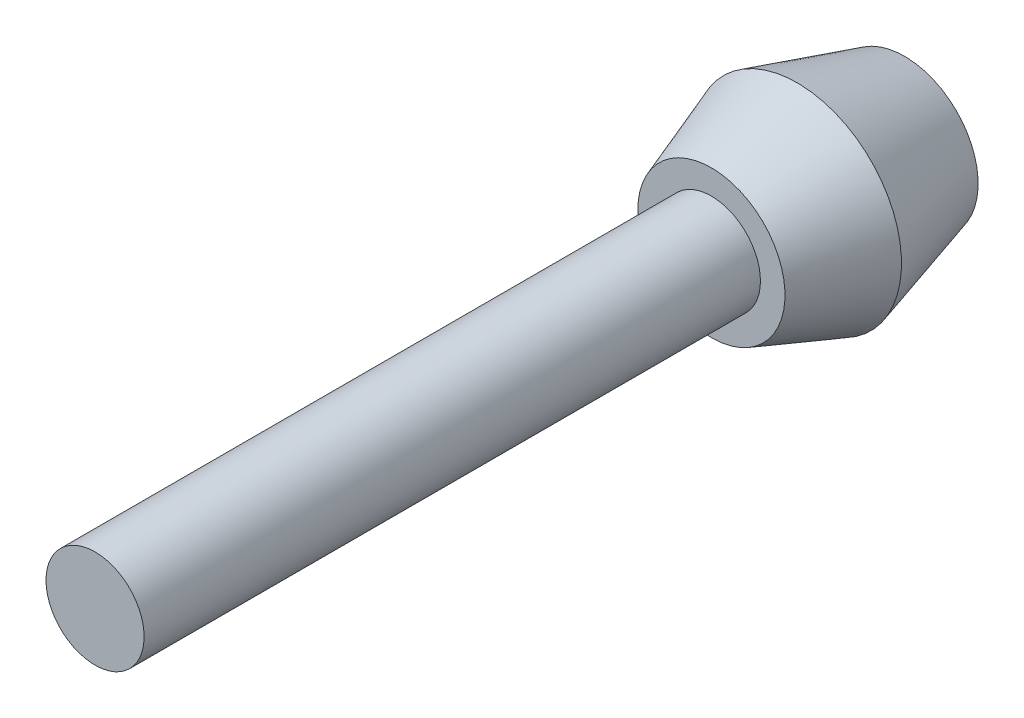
ISO-10303-21;
HEADER;
FILE_DESCRIPTION(('STEP AP214'),'2;1');
FILE_NAME('part.step','',(''),(''),'','','');
FILE_SCHEMA(('AUTOMOTIVE_DESIGN { 1 0 10303 214 1 1 1 1 }'));
ENDSEC;
DATA;
#1=APPLICATION_CONTEXT('core data for automotive mechanical design processes');
#2=APPLICATION_PROTOCOL_DEFINITION('international standard','automotive_design',2000,#1);
#3=PRODUCT_CONTEXT('',#1,'mechanical');
#4=PRODUCT('Part','Part','',(#3));
#5=PRODUCT_RELATED_PRODUCT_CATEGORY('part','',(#4));
#6=PRODUCT_DEFINITION_FORMATION('','',#4);
#7=PRODUCT_DEFINITION_CONTEXT('part definition',#1,'design');
#8=PRODUCT_DEFINITION('design','',#6,#7);
#9=PRODUCT_DEFINITION_SHAPE('','',#8);
#10=(LENGTH_UNIT() NAMED_UNIT(*) SI_UNIT(.MILLI.,.METRE.));
#11=(NAMED_UNIT(*) PLANE_ANGLE_UNIT() SI_UNIT($,.RADIAN.));
#12=(NAMED_UNIT(*) SI_UNIT($,.STERADIAN.) SOLID_ANGLE_UNIT());
#13=UNCERTAINTY_MEASURE_WITH_UNIT(LENGTH_MEASURE(1.E-05),#10,'distance_accuracy_value','');
#14=(GEOMETRIC_REPRESENTATION_CONTEXT(3) GLOBAL_UNCERTAINTY_ASSIGNED_CONTEXT((#13)) GLOBAL_UNIT_ASSIGNED_CONTEXT((#10,
#11,#12)) REPRESENTATION_CONTEXT('',''));
#15=CARTESIAN_POINT('',(0.,0.,0.));
#16=DIRECTION('',(0.,0.,1.));
#17=DIRECTION('',(1.,0.,0.));
#18=AXIS2_PLACEMENT_3D('',#15,#16,#17);
#19=CARTESIAN_POINT('',(0.,0.,0.));
#20=DIRECTION('',(0.,0.,-1.));
#21=DIRECTION('',(0.769107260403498,-0.63911972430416,0.));
#22=AXIS2_PLACEMENT_3D('',#19,#20,#21);
#23=PLANE('',#22);
#24=CARTESIAN_POINT('',(0.,0.,0.));
#25=DIRECTION('',(0.,0.,-1.));
#26=DIRECTION('',(-1.,0.,0.));
#27=AXIS2_PLACEMENT_3D('',#24,#25,#26);
#28=CIRCLE('',#27,6.00000000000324);
#29=CARTESIAN_POINT('',(-6.00000000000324,0.,0.));
#30=VERTEX_POINT('',#29);
#31=EDGE_CURVE('E30',#30,#30,#28,.F.);
#32=ORIENTED_EDGE('',*,*,#31,.F.);
#33=EDGE_LOOP('',(#32));
#34=FACE_BOUND('',#33,.T.);
#35=ADVANCED_FACE('F12',(#34),#23,.T.);
#36=CARTESIAN_POINT('',(0.,0.,8.59564782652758));
#37=DIRECTION('',(0.,0.,1.));
#38=DIRECTION('',(-0.769107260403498,0.63911972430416,0.));
#39=AXIS2_PLACEMENT_3D('',#36,#37,#38);
#40=CONICAL_SURFACE('',#39,8.45589937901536,0.278299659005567);
#41=ORIENTED_EDGE('',*,*,#31,.T.);
#42=EDGE_LOOP('',(#41));
#43=FACE_BOUND('',#42,.T.);
#44=CARTESIAN_POINT('',(0.,0.,8.75000000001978));
#45=DIRECTION('',(0.,0.,-1.));
#46=DIRECTION('',(-1.,0.,0.));
#47=AXIS2_PLACEMENT_3D('',#44,#45,#46);
#48=CIRCLE('',#47,8.50000000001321);
#49=CARTESIAN_POINT('',(-8.50000000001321,0.,8.75000000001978));
#50=VERTEX_POINT('',#49);
#51=EDGE_CURVE('E19',#50,#50,#48,.T.);
#52=ORIENTED_EDGE('',*,*,#51,.T.);
#53=EDGE_LOOP('',(#52));
#54=FACE_BOUND('',#53,.T.);
#55=ADVANCED_FACE('F51',(#43,#54),#40,.T.);
#56=CARTESIAN_POINT('',(0.,0.,8.90117658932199));
#57=DIRECTION('',(0.,0.,-1.));
#58=DIRECTION('',(0.769107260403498,-0.63911972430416,0.));
#59=AXIS2_PLACEMENT_3D('',#56,#57,#58);
#60=CONICAL_SURFACE('',#59,8.44600836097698,0.343023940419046);
#61=CARTESIAN_POINT('',(0.,0.,15.75));
#62=DIRECTION('',(0.,0.,-1.));
#63=DIRECTION('',(-1.,0.,0.));
#64=AXIS2_PLACEMENT_3D('',#61,#62,#63);
#65=CIRCLE('',#64,6.00000000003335);
#66=CARTESIAN_POINT('',(-6.00000000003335,0.,15.75));
#67=VERTEX_POINT('',#66);
#68=EDGE_CURVE('E8',#67,#67,#65,.F.);
#69=ORIENTED_EDGE('',*,*,#68,.F.);
#70=EDGE_LOOP('',(#69));
#71=FACE_BOUND('',#70,.T.);
#72=ORIENTED_EDGE('',*,*,#51,.F.);
#73=EDGE_LOOP('',(#72));
#74=FACE_BOUND('',#73,.T.);
#75=ADVANCED_FACE('F14',(#71,#74),#60,.T.);
#76=CARTESIAN_POINT('',(0.,0.,66.));
#77=DIRECTION('',(0.,0.,-1.));
#78=DIRECTION('',(0.692363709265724,-0.721548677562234,0.));
#79=AXIS2_PLACEMENT_3D('',#76,#77,#78);
#80=PLANE('',#79);
#81=CARTESIAN_POINT('',(0.,0.,66.));
#82=DIRECTION('',(0.,0.,-1.));
#83=DIRECTION('',(-1.,0.,0.));
#84=AXIS2_PLACEMENT_3D('',#81,#82,#83);
#85=CIRCLE('',#84,4.);
#86=CARTESIAN_POINT('',(-4.00000000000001,0.,66.));
#87=VERTEX_POINT('',#86);
#88=EDGE_CURVE('E23',#87,#87,#85,.T.);
#89=ORIENTED_EDGE('',*,*,#88,.F.);
#90=EDGE_LOOP('',(#89));
#91=FACE_BOUND('',#90,.T.);
#92=ADVANCED_FACE('F47',(#91),#80,.F.);
#93=CARTESIAN_POINT('',(0.,0.,2.75));
#94=DIRECTION('',(0.,0.,1.));
#95=DIRECTION('',(-0.692363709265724,0.721548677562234,0.));
#96=AXIS2_PLACEMENT_3D('',#93,#94,#95);
#97=CYLINDRICAL_SURFACE('',#96,4.);
#98=CARTESIAN_POINT('',(0.,0.,15.75));
#99=DIRECTION('',(0.,0.,1.));
#100=DIRECTION('',(-0.769107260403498,0.63911972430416,0.));
#101=AXIS2_PLACEMENT_3D('',#98,#99,#100);
#102=CIRCLE('',#101,4.);
#103=CARTESIAN_POINT('',(-3.07642904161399,2.55647889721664,15.75));
#104=VERTEX_POINT('',#103);
#105=EDGE_CURVE('E27',#104,#104,#102,.T.);
#106=ORIENTED_EDGE('',*,*,#105,.T.);
#107=EDGE_LOOP('',(#106));
#108=FACE_BOUND('',#107,.T.);
#109=ORIENTED_EDGE('',*,*,#88,.T.);
#110=EDGE_LOOP('',(#109));
#111=FACE_BOUND('',#110,.T.);
#112=ADVANCED_FACE('F36',(#108,#111),#97,.T.);
#113=CARTESIAN_POINT('',(0.,0.,15.75));
#114=DIRECTION('',(0.,0.,-1.));
#115=DIRECTION('',(0.769107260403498,-0.63911972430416,0.));
#116=AXIS2_PLACEMENT_3D('',#113,#114,#115);
#117=PLANE('',#116);
#118=ORIENTED_EDGE('',*,*,#105,.F.);
#119=EDGE_LOOP('',(#118));
#120=FACE_BOUND('',#119,.T.);
#121=ORIENTED_EDGE('',*,*,#68,.T.);
#122=EDGE_LOOP('',(#121));
#123=FACE_BOUND('',#122,.T.);
#124=ADVANCED_FACE('F39',(#120,#123),#117,.F.);
#125=CLOSED_SHELL('',(#35,#55,#75,#92,#112,#124));
#126=MANIFOLD_SOLID_BREP('B1',#125);
#127=ADVANCED_BREP_SHAPE_REPRESENTATION('',(#18,#126),#14);
#128=SHAPE_DEFINITION_REPRESENTATION(#9,#127);
ENDSEC;
END-ISO-10303-21;
